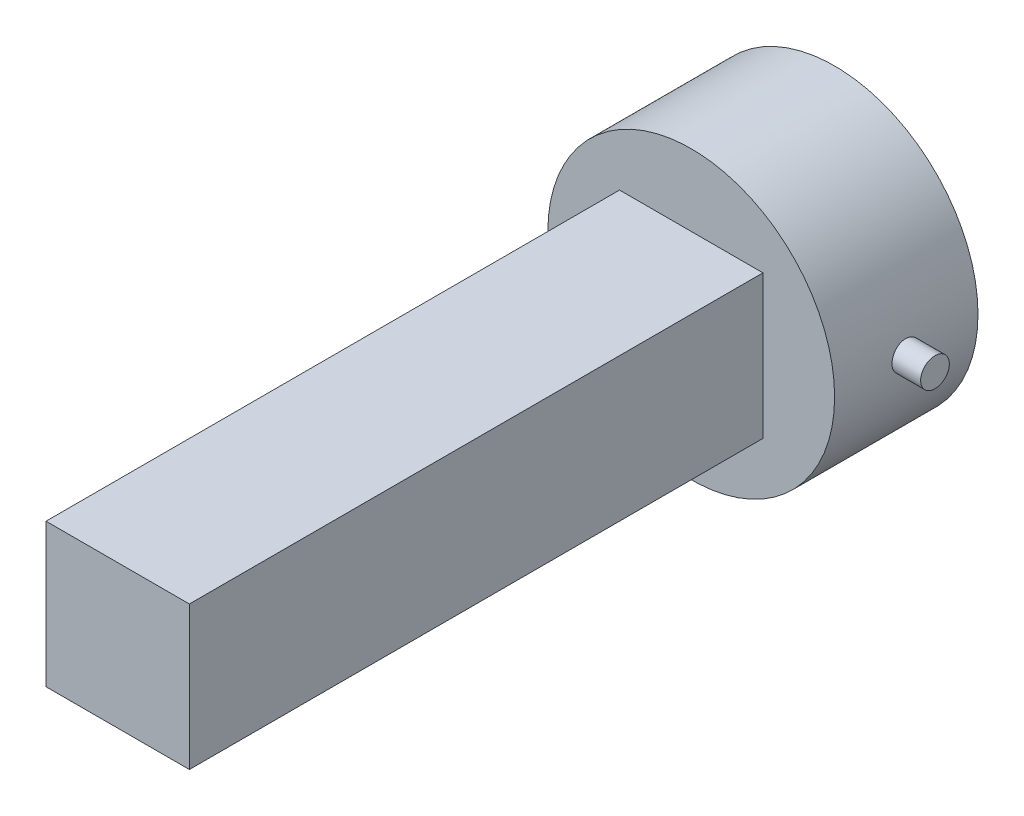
ISO-10303-21;
HEADER;
FILE_DESCRIPTION(('STEP AP214'),'2;1');
FILE_NAME('part.step','',(''),(''),'','','');
FILE_SCHEMA(('AUTOMOTIVE_DESIGN { 1 0 10303 214 1 1 1 1 }'));
ENDSEC;
DATA;
#1=APPLICATION_CONTEXT('core data for automotive mechanical design processes');
#2=APPLICATION_PROTOCOL_DEFINITION('international standard','automotive_design',2000,#1);
#3=PRODUCT_CONTEXT('',#1,'mechanical');
#4=PRODUCT('Part','Part','',(#3));
#5=PRODUCT_RELATED_PRODUCT_CATEGORY('part','',(#4));
#6=PRODUCT_DEFINITION_FORMATION('','',#4);
#7=PRODUCT_DEFINITION_CONTEXT('part definition',#1,'design');
#8=PRODUCT_DEFINITION('design','',#6,#7);
#9=PRODUCT_DEFINITION_SHAPE('','',#8);
#10=(LENGTH_UNIT() NAMED_UNIT(*) SI_UNIT(.MILLI.,.METRE.));
#11=(NAMED_UNIT(*) PLANE_ANGLE_UNIT() SI_UNIT($,.RADIAN.));
#12=(NAMED_UNIT(*) SI_UNIT($,.STERADIAN.) SOLID_ANGLE_UNIT());
#13=UNCERTAINTY_MEASURE_WITH_UNIT(LENGTH_MEASURE(1.E-05),#10,'distance_accuracy_value','');
#14=(GEOMETRIC_REPRESENTATION_CONTEXT(3) GLOBAL_UNCERTAINTY_ASSIGNED_CONTEXT((#13)) GLOBAL_UNIT_ASSIGNED_CONTEXT((#10,
#11,#12)) REPRESENTATION_CONTEXT('',''));
#15=CARTESIAN_POINT('',(0.,0.,0.));
#16=DIRECTION('',(0.,0.,1.));
#17=DIRECTION('',(1.,0.,0.));
#18=AXIS2_PLACEMENT_3D('',#15,#16,#17);
#19=CARTESIAN_POINT('',(0.,0.,25.));
#20=DIRECTION('',(0.,0.,-1.));
#21=DIRECTION('',(-1.,0.,0.));
#22=AXIS2_PLACEMENT_3D('',#19,#20,#21);
#23=CYLINDRICAL_SURFACE('',#22,50.);
#24=CARTESIAN_POINT('',(0.,0.,25.));
#25=DIRECTION('',(0.,0.,1.));
#26=DIRECTION('',(1.,0.,0.));
#27=AXIS2_PLACEMENT_3D('',#24,#25,#26);
#28=CIRCLE('',#27,50.);
#29=CARTESIAN_POINT('',(50.,0.,25.));
#30=VERTEX_POINT('',#29);
#31=EDGE_CURVE('E55',#30,#30,#28,.T.);
#32=ORIENTED_EDGE('',*,*,#31,.F.);
#33=EDGE_LOOP('',(#32));
#34=FACE_BOUND('',#33,.T.);
#35=CARTESIAN_POINT('',(0.,0.,-25.));
#36=DIRECTION('',(0.,0.,1.));
#37=DIRECTION('',(1.,0.,0.));
#38=AXIS2_PLACEMENT_3D('',#35,#36,#37);
#39=CIRCLE('',#38,50.);
#40=CARTESIAN_POINT('',(50.,0.,-25.));
#41=VERTEX_POINT('',#40);
#42=EDGE_CURVE('E108',#41,#41,#39,.T.);
#43=ORIENTED_EDGE('',*,*,#42,.T.);
#44=EDGE_LOOP('',(#43));
#45=FACE_BOUND('',#44,.T.);
#46=CARTESIAN_POINT('',(50.,0.,5.));
#47=CARTESIAN_POINT('',(50.0000003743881,-0.140100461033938,5.00000137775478));
#48=CARTESIAN_POINT('',(49.9994099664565,-0.280179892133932,4.99410933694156));
#49=CARTESIAN_POINT('',(49.9970656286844,-0.559384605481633,4.97058491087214));
#50=CARTESIAN_POINT('',(49.9953114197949,-0.698509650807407,4.95294970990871));
#51=CARTESIAN_POINT('',(49.990686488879,-0.974876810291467,4.90604505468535));
#52=CARTESIAN_POINT('',(49.9878148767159,-1.11211733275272,4.87676632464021));
#53=CARTESIAN_POINT('',(49.9810352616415,-1.38367953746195,4.80677631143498));
#54=CARTESIAN_POINT('',(49.9771268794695,-1.51800013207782,4.76606084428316));
#55=CARTESIAN_POINT('',(49.968388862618,-1.78258815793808,4.67354279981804));
#56=CARTESIAN_POINT('',(49.9635601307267,-1.9128594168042,4.62175108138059));
#57=CARTESIAN_POINT('',(49.9531129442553,-2.16861600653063,4.5074087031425));
#58=CARTESIAN_POINT('',(49.9474941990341,-2.29409955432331,4.44485408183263));
#59=CARTESIAN_POINT('',(49.9356297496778,-2.53927920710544,4.30948482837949));
#60=CARTESIAN_POINT('',(49.9293844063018,-2.65897858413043,4.23667609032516));
#61=CARTESIAN_POINT('',(49.9164369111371,-2.89187409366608,4.08125842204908));
#62=CARTESIAN_POINT('',(49.90973459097,-3.00506780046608,3.99864587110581));
#63=CARTESIAN_POINT('',(49.8960438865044,-3.22442516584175,3.82397629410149));
#64=CARTESIAN_POINT('',(49.8890547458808,-3.33056800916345,3.73189318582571));
#65=CARTESIAN_POINT('',(49.8750029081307,-3.53476522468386,3.53909021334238));
#66=CARTESIAN_POINT('',(49.8679401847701,-3.6328165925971,3.43836716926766));
#67=CARTESIAN_POINT('',(49.853945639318,-3.82006793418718,3.22905453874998));
#68=CARTESIAN_POINT('',(49.8470137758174,-3.90927074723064,3.1204674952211));
#69=CARTESIAN_POINT('',(49.8334722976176,-4.07826305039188,2.89611823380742));
#70=CARTESIAN_POINT('',(49.8268628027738,-4.15804905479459,2.78035338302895));
#71=CARTESIAN_POINT('',(49.8141453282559,-4.30773494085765,2.54228707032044));
#72=CARTESIAN_POINT('',(49.8080382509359,-4.37761719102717,2.4199744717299));
#73=CARTESIAN_POINT('',(49.796510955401,-4.50685113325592,2.16982101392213));
#74=CARTESIAN_POINT('',(49.7910909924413,-4.56619891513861,2.04197812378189));
#75=CARTESIAN_POINT('',(49.7810984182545,-4.67388203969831,1.78175094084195));
#76=CARTESIAN_POINT('',(49.7765254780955,-4.72222165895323,1.64936843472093));
#77=CARTESIAN_POINT('',(49.7683532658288,-4.80757979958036,1.38095897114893));
#78=CARTESIAN_POINT('',(49.7647543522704,-4.84459415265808,1.24493069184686));
#79=CARTESIAN_POINT('',(49.7556112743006,-4.93794230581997,0.83384947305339));
#80=CARTESIAN_POINT('',(49.7516744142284,-4.97706409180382,0.554629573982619));
#81=CARTESIAN_POINT('',(49.7485802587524,-5.00789059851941,-0.00628677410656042));
#82=CARTESIAN_POINT('',(49.7494228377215,-4.9995965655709,-0.287983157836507));
#83=CARTESIAN_POINT('',(49.7557708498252,-4.93601762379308,-0.84496523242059));
#84=CARTESIAN_POINT('',(49.7612593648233,-4.88090320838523,-1.1202704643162));
#85=CARTESIAN_POINT('',(49.7762565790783,-4.72549673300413,-1.65769284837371));
#86=CARTESIAN_POINT('',(49.7857653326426,-4.62520406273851,-1.91980982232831));
#87=CARTESIAN_POINT('',(49.8077505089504,-4.3821041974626,-2.42396712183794));
#88=CARTESIAN_POINT('',(49.8202322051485,-4.23922134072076,-2.66597072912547));
#89=CARTESIAN_POINT('',(49.846752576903,-3.91505020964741,-3.12262629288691));
#90=CARTESIAN_POINT('',(49.8607912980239,-3.73376081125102,-3.3372774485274));
#91=CARTESIAN_POINT('',(49.8889192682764,-3.33697054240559,-3.73412691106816));
#92=CARTESIAN_POINT('',(49.9030084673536,-3.12132238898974,-3.91617799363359));
#93=CARTESIAN_POINT('',(49.9295914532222,-2.66244741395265,-4.2415181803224));
#94=CARTESIAN_POINT('',(49.9420852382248,-2.41922056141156,-4.38480724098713));
#95=CARTESIAN_POINT('',(49.9640737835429,-1.91199052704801,-4.62855009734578));
#96=CARTESIAN_POINT('',(49.9735680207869,-1.64798373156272,-4.72899642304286));
#97=CARTESIAN_POINT('',(49.988482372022,-1.10673608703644,-4.88409458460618));
#98=CARTESIAN_POINT('',(49.9939026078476,-0.829495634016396,-4.9387477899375));
#99=CARTESIAN_POINT('',(50.0000425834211,-0.270925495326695,-5.00052153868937));
#100=CARTESIAN_POINT('',(50.000782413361,0.0103815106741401,-5.007845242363));
#101=CARTESIAN_POINT('',(49.9975320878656,0.570218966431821,-4.97528568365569));
#102=CARTESIAN_POINT('',(49.993541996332,0.848749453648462,-4.93540305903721));
#103=CARTESIAN_POINT('',(49.9812930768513,1.39454103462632,-4.80973152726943));
#104=CARTESIAN_POINT('',(49.9730430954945,1.66182424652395,-4.72403774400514));
#105=CARTESIAN_POINT('',(49.953199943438,2.17822160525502,-4.50927411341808));
#106=CARTESIAN_POINT('',(49.9416066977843,2.42733534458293,-4.38020329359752));
#107=CARTESIAN_POINT('',(49.9163237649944,2.90124090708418,-4.08184586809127));
#108=CARTESIAN_POINT('',(49.9026271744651,3.12594832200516,-3.9124257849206));
#109=CARTESIAN_POINT('',(49.8746966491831,3.54380809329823,-3.53836943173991));
#110=CARTESIAN_POINT('',(49.8604627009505,3.73695965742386,-3.33373227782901));
#111=CARTESIAN_POINT('',(49.8330011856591,4.08693063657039,-2.89416798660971));
#112=CARTESIAN_POINT('',(49.8197774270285,4.2436167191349,-2.65913443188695));
#113=CARTESIAN_POINT('',(49.7958917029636,4.5152909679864,-2.16595998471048));
#114=CARTESIAN_POINT('',(49.7852297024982,4.63027970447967,-1.90781940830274));
#115=CARTESIAN_POINT('',(49.7676970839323,4.81507725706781,-1.37626827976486));
#116=CARTESIAN_POINT('',(49.7608198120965,4.88496539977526,-1.10288546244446));
#117=CARTESIAN_POINT('',(49.7516193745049,4.97781551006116,-0.548039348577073));
#118=CARTESIAN_POINT('',(49.7492960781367,5.00077882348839,-0.266576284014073));
#119=CARTESIAN_POINT('',(49.7494127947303,4.99958027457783,0.154607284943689));
#120=CARTESIAN_POINT('',(49.7500479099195,4.99328044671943,0.294599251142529));
#121=CARTESIAN_POINT('',(49.7524830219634,4.96896519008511,0.573537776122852));
#122=CARTESIAN_POINT('',(49.754282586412,4.9509541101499,0.712484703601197));
#123=CARTESIAN_POINT('',(49.7589979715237,4.90333392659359,0.988399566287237));
#124=CARTESIAN_POINT('',(49.7619142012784,4.87372057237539,1.12536675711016));
#125=CARTESIAN_POINT('',(49.7687776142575,4.80312740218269,1.39626233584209));
#126=CARTESIAN_POINT('',(49.7727244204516,4.7621517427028,1.53019181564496));
#127=CARTESIAN_POINT('',(49.7815382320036,4.66911475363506,1.79414455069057));
#128=CARTESIAN_POINT('',(49.7864054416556,4.61705096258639,1.92416693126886));
#129=CARTESIAN_POINT('',(49.7969192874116,4.50223825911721,2.17931501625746));
#130=CARTESIAN_POINT('',(49.8025656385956,4.43949325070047,2.30444248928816));
#131=CARTESIAN_POINT('',(49.8144815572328,4.30372744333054,2.54901935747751));
#132=CARTESIAN_POINT('',(49.82075134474,4.23070301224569,2.66846672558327));
#133=CARTESIAN_POINT('',(49.8337332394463,4.07493978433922,2.90076102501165));
#134=CARTESIAN_POINT('',(49.8404451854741,3.99220451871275,3.01361033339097));
#135=CARTESIAN_POINT('',(49.8541564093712,3.81717528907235,3.23247543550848));
#136=CARTESIAN_POINT('',(49.8611568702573,3.72483897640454,3.33845729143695));
#137=CARTESIAN_POINT('',(49.8752152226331,3.53161206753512,3.54223440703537));
#138=CARTESIAN_POINT('',(49.8822730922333,3.43072460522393,3.64003264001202));
#139=CARTESIAN_POINT('',(49.8962537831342,3.22101009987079,3.82685596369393));
#140=CARTESIAN_POINT('',(49.9031765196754,3.11217826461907,3.91587568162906));
#141=CARTESIAN_POINT('',(49.9166844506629,2.88743471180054,4.08441457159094));
#142=CARTESIAN_POINT('',(49.9232697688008,2.77152562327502,4.16393723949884));
#143=CARTESIAN_POINT('',(49.9359380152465,2.5330592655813,4.31317189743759));
#144=CARTESIAN_POINT('',(49.9420194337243,2.41048371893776,4.38285481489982));
#145=CARTESIAN_POINT('',(49.9534835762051,2.15990777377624,4.51161097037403));
#146=CARTESIAN_POINT('',(49.9588665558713,2.03190938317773,4.57068809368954));
#147=CARTESIAN_POINT('',(49.9687792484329,1.77145809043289,4.67779263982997));
#148=CARTESIAN_POINT('',(49.9733096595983,1.63900893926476,4.7258291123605));
#149=CARTESIAN_POINT('',(49.9813929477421,1.37054695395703,4.8105524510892));
#150=CARTESIAN_POINT('',(49.9849460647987,1.23453500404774,4.84724210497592));
#151=CARTESIAN_POINT('',(49.9919068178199,0.917364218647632,4.91857667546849));
#152=CARTESIAN_POINT('',(49.9949297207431,0.735250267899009,4.94908106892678));
#153=CARTESIAN_POINT('',(49.9989760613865,0.368745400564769,4.98979178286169));
#154=CARTESIAN_POINT('',(49.9999995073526,0.184354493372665,4.9999981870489));
#155=CARTESIAN_POINT('',(50.,0.,5.));
#156=B_SPLINE_CURVE_WITH_KNOTS('',3,(#46,#47,#48,#49,#50,#51,#52,#53,#54,#55,#56,#57,#58,#59,
#60,#61,#62,#63,#64,#65,#66,#67,#68,#69,#70,#71,#72,#73,#74,#75,#76,#77,#78,#79,#80,#81,#82,#83,
#84,#85,#86,#87,#88,#89,#90,#91,#92,#93,#94,#95,#96,#97,#98,#99,#100,#101,#102,#103,#104,#105,
#106,#107,#108,#109,#110,#111,#112,#113,#114,#115,#116,#117,#118,#119,#120,#121,#122,#123,#124,
#125,#126,#127,#128,#129,#130,#131,#132,#133,#134,#135,#136,#137,#138,#139,#140,#141,#142,#143,
#144,#145,#146,#147,#148,#149,#150,#151,#152,#153,#154,#155),.UNSPECIFIED.,.T.,.F.,(4,2,2,2,2,2,
2,2,2,2,2,2,2,2,2,2,2,2,2,2,2,2,2,2,2,2,2,2,2,2,2,2,2,2,2,2,2,2,2,2,2,2,2,2,2,2,2,2,2,2,2,2,2,2,
4),(0.,0.420140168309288,0.840381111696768,1.26095751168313,1.68168797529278,2.10200784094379,
2.52248274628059,2.94271694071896,3.36310682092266,3.78468715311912,4.20642331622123,
4.62802370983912,5.04977967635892,5.47227730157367,5.89493142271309,6.31742106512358,
6.74006601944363,7.58160289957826,8.42311766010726,9.26158116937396,10.1000560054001,
10.9400293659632,11.7800273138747,12.6237280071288,13.467429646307,14.3112783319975,
15.1551017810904,15.9953007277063,16.8354883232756,17.6739380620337,18.5124065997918,
19.3536883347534,20.1949911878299,21.0393234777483,21.8836442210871,22.7264758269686,
23.5692832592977,23.9892798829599,24.4091206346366,24.8291153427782,25.2489566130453,
25.6688911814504,26.0886725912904,26.5086027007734,26.9283805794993,27.3500956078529,
27.7716567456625,28.1934743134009,28.6151361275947,29.0380188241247,29.460746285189,
29.883126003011,30.305401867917,30.8582554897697,31.4111068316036),.UNSPECIFIED.);
#157=CARTESIAN_POINT('',(50.,0.,5.));
#158=VERTEX_POINT('',#157);
#159=EDGE_CURVE('E13',#158,#158,#156,.T.);
#160=ORIENTED_EDGE('',*,*,#159,.F.);
#161=EDGE_LOOP('',(#160));
#162=FACE_BOUND('',#161,.T.);
#163=ADVANCED_FACE('F44',(#34,#45,#162),#23,.T.);
#164=CARTESIAN_POINT('',(0.,0.,25.));
#165=DIRECTION('',(0.,0.,1.));
#166=DIRECTION('',(1.,0.,0.));
#167=AXIS2_PLACEMENT_3D('',#164,#165,#166);
#168=PLANE('',#167);
#169=DIRECTION('',(0.,-1.,0.));
#170=VECTOR('',#169,1.);
#171=CARTESIAN_POINT('',(-25.,-25.,25.));
#172=LINE('',#171,#170);
#173=CARTESIAN_POINT('',(-25.,25.,25.));
#174=VERTEX_POINT('',#173);
#175=CARTESIAN_POINT('',(-25.,-25.,25.));
#176=VERTEX_POINT('',#175);
#177=EDGE_CURVE('E62',#174,#176,#172,.T.);
#178=ORIENTED_EDGE('',*,*,#177,.F.);
#179=DIRECTION('',(-1.,0.,0.));
#180=VECTOR('',#179,1.);
#181=CARTESIAN_POINT('',(25.,25.,25.));
#182=LINE('',#181,#180);
#183=CARTESIAN_POINT('',(25.,25.,25.));
#184=VERTEX_POINT('',#183);
#185=EDGE_CURVE('E66',#184,#174,#182,.T.);
#186=ORIENTED_EDGE('',*,*,#185,.F.);
#187=DIRECTION('',(0.,1.,0.));
#188=VECTOR('',#187,1.);
#189=CARTESIAN_POINT('',(25.,-25.,25.));
#190=LINE('',#189,#188);
#191=CARTESIAN_POINT('',(25.,-25.,25.));
#192=VERTEX_POINT('',#191);
#193=EDGE_CURVE('E215',#192,#184,#190,.T.);
#194=ORIENTED_EDGE('',*,*,#193,.F.);
#195=DIRECTION('',(1.,0.,0.));
#196=VECTOR('',#195,1.);
#197=CARTESIAN_POINT('',(25.,-25.,25.));
#198=LINE('',#197,#196);
#199=EDGE_CURVE('E217',#176,#192,#198,.T.);
#200=ORIENTED_EDGE('',*,*,#199,.F.);
#201=EDGE_LOOP('',(#178,#186,#194,#200));
#202=FACE_BOUND('',#201,.T.);
#203=ORIENTED_EDGE('',*,*,#31,.T.);
#204=EDGE_LOOP('',(#203));
#205=FACE_BOUND('',#204,.T.);
#206=ADVANCED_FACE('F118',(#202,#205),#168,.T.);
#207=CARTESIAN_POINT('',(0.,0.,-25.));
#208=DIRECTION('',(0.,0.,1.));
#209=DIRECTION('',(1.,0.,0.));
#210=AXIS2_PLACEMENT_3D('',#207,#208,#209);
#211=PLANE('',#210);
#212=ORIENTED_EDGE('',*,*,#42,.F.);
#213=EDGE_LOOP('',(#212));
#214=FACE_BOUND('',#213,.T.);
#215=ADVANCED_FACE('F152',(#214),#211,.F.);
#216=CARTESIAN_POINT('',(-25.,-25.,225.));
#217=DIRECTION('',(1.,0.,0.));
#218=DIRECTION('',(0.,0.,-1.));
#219=AXIS2_PLACEMENT_3D('',#216,#217,#218);
#220=PLANE('',#219);
#221=ORIENTED_EDGE('',*,*,#177,.T.);
#222=DIRECTION('',(0.,0.,-1.));
#223=VECTOR('',#222,1.);
#224=CARTESIAN_POINT('',(-25.,-25.,225.));
#225=LINE('',#224,#223);
#226=CARTESIAN_POINT('',(-25.,-25.,225.));
#227=VERTEX_POINT('',#226);
#228=EDGE_CURVE('E91',#227,#176,#225,.T.);
#229=ORIENTED_EDGE('',*,*,#228,.F.);
#230=DIRECTION('',(0.,-1.,0.));
#231=VECTOR('',#230,1.);
#232=CARTESIAN_POINT('',(-25.,-25.,225.));
#233=LINE('',#232,#231);
#234=CARTESIAN_POINT('',(-25.,25.,225.));
#235=VERTEX_POINT('',#234);
#236=EDGE_CURVE('E97',#235,#227,#233,.T.);
#237=ORIENTED_EDGE('',*,*,#236,.F.);
#238=DIRECTION('',(0.,0.,-1.));
#239=VECTOR('',#238,1.);
#240=CARTESIAN_POINT('',(-25.,25.,225.));
#241=LINE('',#240,#239);
#242=EDGE_CURVE('E219',#235,#174,#241,.T.);
#243=ORIENTED_EDGE('',*,*,#242,.T.);
#244=EDGE_LOOP('',(#221,#229,#237,#243));
#245=FACE_BOUND('',#244,.T.);
#246=ADVANCED_FACE('F107',(#245),#220,.F.);
#247=CARTESIAN_POINT('',(25.,-25.,225.));
#248=DIRECTION('',(0.,1.,0.));
#249=DIRECTION('',(-1.,0.,0.));
#250=AXIS2_PLACEMENT_3D('',#247,#248,#249);
#251=PLANE('',#250);
#252=ORIENTED_EDGE('',*,*,#199,.T.);
#253=DIRECTION('',(0.,0.,-1.));
#254=VECTOR('',#253,1.);
#255=CARTESIAN_POINT('',(25.,-25.,225.));
#256=LINE('',#255,#254);
#257=CARTESIAN_POINT('',(25.,-25.,225.));
#258=VERTEX_POINT('',#257);
#259=EDGE_CURVE('E93',#258,#192,#256,.T.);
#260=ORIENTED_EDGE('',*,*,#259,.F.);
#261=DIRECTION('',(1.,0.,0.));
#262=VECTOR('',#261,1.);
#263=CARTESIAN_POINT('',(25.,-25.,225.));
#264=LINE('',#263,#262);
#265=EDGE_CURVE('E86',#227,#258,#264,.T.);
#266=ORIENTED_EDGE('',*,*,#265,.F.);
#267=ORIENTED_EDGE('',*,*,#228,.T.);
#268=EDGE_LOOP('',(#252,#260,#266,#267));
#269=FACE_BOUND('',#268,.T.);
#270=ADVANCED_FACE('F89',(#269),#251,.F.);
#271=CARTESIAN_POINT('',(25.,-25.,225.));
#272=DIRECTION('',(-1.,0.,0.));
#273=DIRECTION('',(0.,0.,1.));
#274=AXIS2_PLACEMENT_3D('',#271,#272,#273);
#275=PLANE('',#274);
#276=ORIENTED_EDGE('',*,*,#193,.T.);
#277=DIRECTION('',(0.,0.,-1.));
#278=VECTOR('',#277,1.);
#279=CARTESIAN_POINT('',(25.,25.,225.));
#280=LINE('',#279,#278);
#281=CARTESIAN_POINT('',(25.,25.,225.));
#282=VERTEX_POINT('',#281);
#283=EDGE_CURVE('E111',#282,#184,#280,.T.);
#284=ORIENTED_EDGE('',*,*,#283,.F.);
#285=DIRECTION('',(0.,1.,0.));
#286=VECTOR('',#285,1.);
#287=CARTESIAN_POINT('',(25.,-25.,225.));
#288=LINE('',#287,#286);
#289=EDGE_CURVE('E96',#258,#282,#288,.T.);
#290=ORIENTED_EDGE('',*,*,#289,.F.);
#291=ORIENTED_EDGE('',*,*,#259,.T.);
#292=EDGE_LOOP('',(#276,#284,#290,#291));
#293=FACE_BOUND('',#292,.T.);
#294=ADVANCED_FACE('F143',(#293),#275,.F.);
#295=CARTESIAN_POINT('',(25.,25.,225.));
#296=DIRECTION('',(0.,-1.,0.));
#297=DIRECTION('',(1.,0.,0.));
#298=AXIS2_PLACEMENT_3D('',#295,#296,#297);
#299=PLANE('',#298);
#300=ORIENTED_EDGE('',*,*,#185,.T.);
#301=ORIENTED_EDGE('',*,*,#242,.F.);
#302=DIRECTION('',(-1.,0.,0.));
#303=VECTOR('',#302,1.);
#304=CARTESIAN_POINT('',(25.,25.,225.));
#305=LINE('',#304,#303);
#306=EDGE_CURVE('E102',#282,#235,#305,.T.);
#307=ORIENTED_EDGE('',*,*,#306,.F.);
#308=ORIENTED_EDGE('',*,*,#283,.T.);
#309=EDGE_LOOP('',(#300,#301,#307,#308));
#310=FACE_BOUND('',#309,.T.);
#311=ADVANCED_FACE('F136',(#310),#299,.F.);
#312=CARTESIAN_POINT('',(0.,0.,225.));
#313=DIRECTION('',(0.,0.,1.));
#314=DIRECTION('',(1.,0.,0.));
#315=AXIS2_PLACEMENT_3D('',#312,#313,#314);
#316=PLANE('',#315);
#317=ORIENTED_EDGE('',*,*,#236,.T.);
#318=ORIENTED_EDGE('',*,*,#265,.T.);
#319=ORIENTED_EDGE('',*,*,#289,.T.);
#320=ORIENTED_EDGE('',*,*,#306,.T.);
#321=EDGE_LOOP('',(#317,#318,#319,#320));
#322=FACE_BOUND('',#321,.T.);
#323=ADVANCED_FACE('F100',(#322),#316,.T.);
#324=CARTESIAN_POINT('',(60.,0.,0.));
#325=DIRECTION('',(-1.,0.,0.));
#326=DIRECTION('',(0.,0.,1.));
#327=AXIS2_PLACEMENT_3D('',#324,#325,#326);
#328=CYLINDRICAL_SURFACE('',#327,5.);
#329=CARTESIAN_POINT('',(60.,0.,0.));
#330=DIRECTION('',(1.,0.,0.));
#331=DIRECTION('',(0.,0.,-1.));
#332=AXIS2_PLACEMENT_3D('',#329,#330,#331);
#333=CIRCLE('',#332,5.);
#334=CARTESIAN_POINT('',(60.,0.,-5.));
#335=VERTEX_POINT('',#334);
#336=EDGE_CURVE('E225',#335,#335,#333,.T.);
#337=ORIENTED_EDGE('',*,*,#336,.F.);
#338=EDGE_LOOP('',(#337));
#339=FACE_BOUND('',#338,.T.);
#340=ORIENTED_EDGE('',*,*,#159,.T.);
#341=EDGE_LOOP('',(#340));
#342=FACE_BOUND('',#341,.T.);
#343=ADVANCED_FACE('F126',(#339,#342),#328,.T.);
#344=CARTESIAN_POINT('',(60.,0.,0.));
#345=DIRECTION('',(1.,0.,0.));
#346=DIRECTION('',(0.,0.,-1.));
#347=AXIS2_PLACEMENT_3D('',#344,#345,#346);
#348=PLANE('',#347);
#349=ORIENTED_EDGE('',*,*,#336,.T.);
#350=EDGE_LOOP('',(#349));
#351=FACE_BOUND('',#350,.T.);
#352=ADVANCED_FACE('F128',(#351),#348,.T.);
#353=CLOSED_SHELL('',(#163,#206,#215,#246,#270,#294,#311,#323,#343,#352));
#354=MANIFOLD_SOLID_BREP('B2',#353);
#355=ADVANCED_BREP_SHAPE_REPRESENTATION('',(#18,#354),#14);
#356=SHAPE_DEFINITION_REPRESENTATION(#9,#355);
ENDSEC;
END-ISO-10303-21;
